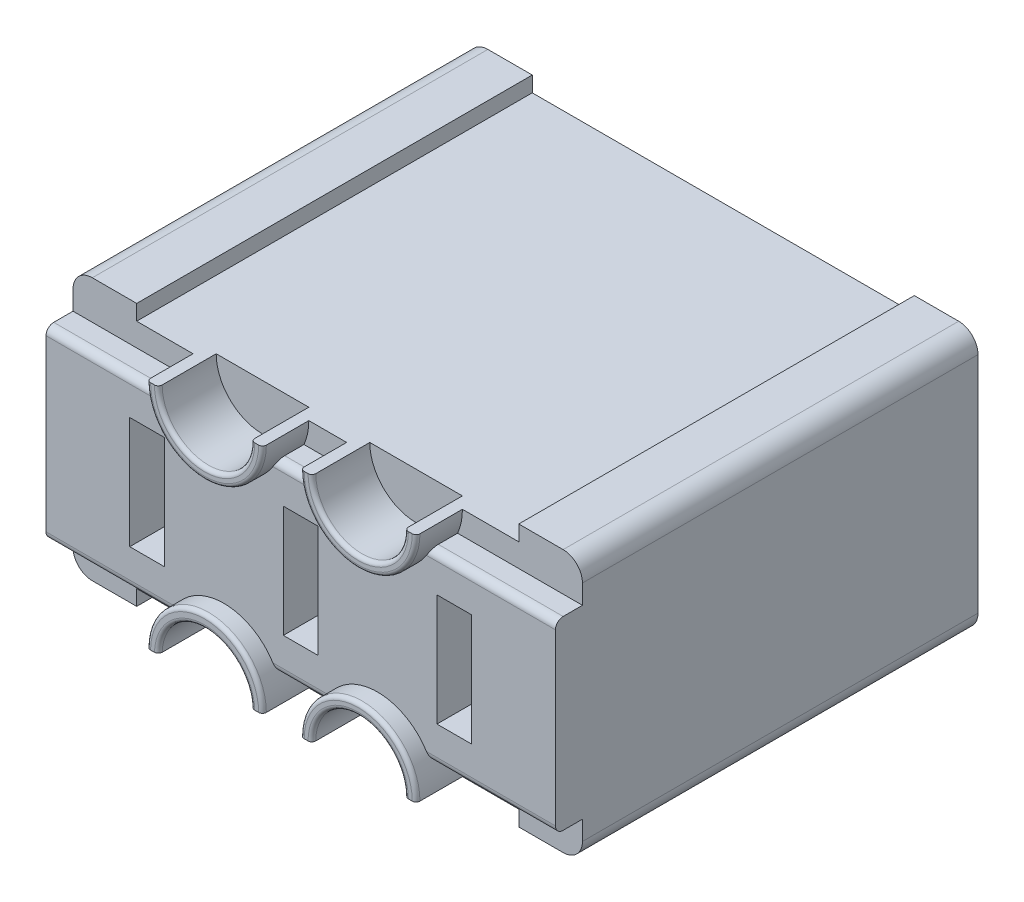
from build123d import *

# Parameters (mm, degrees)
ESQUISSE1_W             = 13.199999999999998
ESQUISSE1_H             = 6.799999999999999
BOSS_EXTRU_1_DEPTH      = 11.45
ESQUISSE2_W             = 9.9
ESQUISSE2_H             = 0.4
ENL_V_MAT_EXTRU_1_DEPTH = 19.75053332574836
ENL_V_MAT_EXTRU_4_DEPTH = 0.5
ENL_V_MAT_EXTRU_5_DEPTH = 1.5
ENL_V_MAT_EXTRU_7_DEPTH = 0.7
CONG_2_R                = 0.5
CONG_3_R                = 0.1
CONG_4_R                = 0.2
ESQUISSE7_W             = 0.8999999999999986
ESQUISSE7_H             = 2.9000000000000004
ENL_V_MAT_EXTRU_8_DEPTH = 19.44945811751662
ESQUISSE8_W             = 9.899999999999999
ESQUISSE8_H             = 4.399999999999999
ENL_V_MAT_EXTRU_9_DEPTH = 0.5


with BuildPart() as part:
    # Esquisse1 → Boss.-Extru.1 (new body)
    with BuildSketch(Plane.XY):
        with Locations((6.599999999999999, 3.3999999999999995)):
            Rectangle(ESQUISSE1_W, ESQUISSE1_H)
    extrude(amount=-BOSS_EXTRU_1_DEPTH)

    # Esquisse2 → Enl_v. mat.-Extru.1 (cut, through all)
    with BuildSketch(Plane.XY):
        Polygon((1.6500000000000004, 6.8), (11.55, 6.8), (11.55, 6.3999999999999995), (1.65, 6.3999999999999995), align=None)
        with Locations((6.6000000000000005, 0.2)):
            Rectangle(ESQUISSE2_W, ESQUISSE2_H)
    extrude(amount=-ENL_V_MAT_EXTRU_1_DEPTH, mode=Mode.SUBTRACT)

    # Esquisse4 → Enl_v. mat.-Extru.4 (cut)
    with BuildSketch(Plane.XY):
        with BuildLine():
            Line((3.1099999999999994, 6.3999999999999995), (1.65, 6.3999999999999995))
            Line((1.65, 6.3999999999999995), (1.6500000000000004, 6.8))
            Line((1.6500000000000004, 6.8), (0, 6.8))
            Line((0, 6.8), (0, 0))
            Line((0, 0), (1.65, 0))
            Line((1.65, 0), (1.65, 0.4))
            Line((1.65, 0.4), (3.1100000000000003, 0.4))
            ThreePointArc((3.1100000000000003, 0.4), (4.61, 1.9000000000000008), (6.110000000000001, 0.4))
            Line((6.110000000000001, 0.4), (7.090000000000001, 0.4))
            ThreePointArc((7.090000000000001, 0.4), (8.59, 1.9), (10.09, 0.4))
            Line((10.09, 0.4), (11.55, 0.4))
            Line((11.55, 0.4), (11.55, 0))
            Line((11.55, 0), (13.199999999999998, 0))
            Line((13.199999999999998, 0), (13.199999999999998, 6.800000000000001))
            Line((13.199999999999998, 6.800000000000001), (11.55, 6.8))
            Line((11.55, 6.8), (11.55, 6.3999999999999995))
            Line((11.55, 6.3999999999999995), (10.09, 6.3999999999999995))
            ThreePointArc((10.09, 6.3999999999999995), (8.59, 4.9), (7.090000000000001, 6.3999999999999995))
            Line((7.090000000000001, 6.3999999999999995), (6.109999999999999, 6.3999999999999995))
            ThreePointArc((6.109999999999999, 6.3999999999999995), (4.609999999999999, 4.8999999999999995), (3.1099999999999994, 6.3999999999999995))
        make_face()
    extrude(amount=-ENL_V_MAT_EXTRU_4_DEPTH, mode=Mode.SUBTRACT)

    # Esquisse5 → Enl_v. mat.-Extru.5 (cut)
    with BuildSketch(Plane.XY):
        with BuildLine():
            Line((3.4099999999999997, 6.3999999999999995), (5.81, 6.3999999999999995))
            ThreePointArc((5.81, 6.3999999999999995), (4.609999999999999, 5.199999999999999), (3.4099999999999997, 6.3999999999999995))
        make_face()
        with BuildLine():
            Line((7.390000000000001, 6.3999999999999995), (9.790000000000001, 6.3999999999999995))
            ThreePointArc((9.790000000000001, 6.3999999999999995), (8.59, 5.199999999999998), (7.390000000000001, 6.3999999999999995))
        make_face()
        with BuildLine():
            Line((3.4104721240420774, 0.4), (5.809527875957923, 0.4))
            ThreePointArc((5.809527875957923, 0.4), (4.61, 1.5663417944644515), (3.4104721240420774, 0.4))
        make_face()
        with BuildLine():
            Line((7.390000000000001, 0.3999999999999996), (9.790000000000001, 0.39999999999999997))
            ThreePointArc((9.790000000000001, 0.39999999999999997), (8.59, 1.600000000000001), (7.390000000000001, 0.3999999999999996))
        make_face()
    extrude(amount=-ENL_V_MAT_EXTRU_5_DEPTH, mode=Mode.SUBTRACT)

    # Esquisse6 → Enl_v. mat.-Extru.7 (cut)
    with BuildSketch(Plane.XY.offset(-0.5)):
        with BuildLine():
            ThreePointArc((3.2352272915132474, 5.8), (3.1416405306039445, 6.09353553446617), (3.1099999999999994, 6.3999999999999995))
            Line((3.1099999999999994, 6.3999999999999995), (1.65, 6.3999999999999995))
            Line((1.65, 6.3999999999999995), (1.6500000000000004, 6.8))
            Line((1.6500000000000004, 6.8), (0, 6.8))
            Line((0, 6.8), (0, 5.8))
            Line((0, 5.8), (3.2352272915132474, 5.8))
        make_face()
        with BuildLine():
            ThreePointArc((6.109999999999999, 6.3999999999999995), (6.078359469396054, 6.09353553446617), (5.9847727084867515, 5.8))
            Line((5.9847727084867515, 5.8), (7.215227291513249, 5.8))
            ThreePointArc((7.215227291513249, 5.8), (7.121640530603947, 6.093535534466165), (7.090000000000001, 6.399999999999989))
            Line((7.090000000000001, 6.399999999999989), (6.109999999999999, 6.3999999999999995))
        make_face()
        with BuildLine():
            ThreePointArc((10.09, 6.3999999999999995), (10.058359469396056, 6.09353553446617), (9.964772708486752, 5.8))
            Line((9.964772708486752, 5.8), (13.199999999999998, 5.8))
            Line((13.199999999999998, 5.8), (13.199999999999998, 6.800000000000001))
            Line((13.199999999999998, 6.800000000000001), (11.55, 6.8))
            Line((11.55, 6.8), (11.55, 6.3999999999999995))
            Line((11.55, 6.3999999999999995), (10.09, 6.3999999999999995))
        make_face()
        with BuildLine():
            Line((13.199999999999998, 0), (13.199999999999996, 1))
            Line((13.199999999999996, 1), (9.964772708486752, 1))
            ThreePointArc((9.964772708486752, 1), (10.058359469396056, 0.7064644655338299), (10.09, 0.39999999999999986))
            Line((10.09, 0.4), (11.55, 0.4))
            Line((11.55, 0.4), (11.55, 0))
            Line((11.55, 0), (13.199999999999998, 0))
        make_face()
        with BuildLine():
            Line((7.215227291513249, 1), (5.9847727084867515, 1))
            ThreePointArc((5.9847727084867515, 1), (6.078359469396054, 0.7064644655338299), (6.109999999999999, 0.3999999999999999))
            Line((6.109999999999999, 0.4), (7.090000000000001, 0.4000000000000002))
            ThreePointArc((7.090000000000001, 0.4000000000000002), (7.121640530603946, 0.70646446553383), (7.215227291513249, 1))
        make_face()
        with BuildLine():
            Line((3.2352272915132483, 1), (0, 1))
            Line((0, 1), (0, 0))
            Line((0, 0), (1.65, 0))
            Line((1.65, 0), (1.65, 0.4))
            Line((1.65, 0.4), (3.1100000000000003, 0.4))
            ThreePointArc((3.1100000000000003, 0.4), (3.1416405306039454, 0.7064644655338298), (3.2352272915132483, 0.9999999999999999))
        make_face()
    extrude(amount=-ENL_V_MAT_EXTRU_7_DEPTH, mode=Mode.SUBTRACT)

    # Cong_2
    cong_2_edges = [part.edges().sort_by_distance(p)[0] for p in [
        (0, 6.8, -6.325),
        (13.199999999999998, 6.8, -6.325),
        (13.199999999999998, 0, -6.325),
        (0, 0, -6.325),
    ]]
    fillet(cong_2_edges, radius=CONG_2_R)

    # Cong_3
    cong_3_edges = [part.edges().sort_by_distance(p)[0] for p in [
        (4.609999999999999, 5.199999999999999, 0),
        (8.590000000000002, 5.199999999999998, 0),
        (4.61, 1.5663417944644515, 0),
        (8.590000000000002, 1.6000000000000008, 0),
        (4.609999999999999, 4.8999999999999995, 0),
        (4.610000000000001, 1.9000000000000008, 0),
        (8.59, 1.9, 0),
        (8.59, 4.9, 0),
    ]]
    fillet(cong_3_edges, radius=CONG_3_R)

    # Cong_4
    cong_4_edges = [part.edges().sort_by_distance(p)[0] for p in [
        (1.6176136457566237, 5.8, -0.5),
        (6.6, 5.8, -0.5),
        (11.582386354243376, 5.8, -0.5),
        (11.582386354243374, 1, -0.5),
        (6.6, 1, -0.5),
        (1.6176136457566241, 1, -0.5),
    ]]
    fillet(cong_4_edges, radius=CONG_4_R)

    # Esquisse7 → Enl_v. mat.-Extru.8 (cut, through all)
    with BuildSketch(Plane.XY.offset(-0.5)):
        Polygon((2.169999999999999, 4.8500000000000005), (3.0699999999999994, 4.8500000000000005), (3.07, 1.9500000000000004), (2.1699999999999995, 1.9500000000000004), align=None)
        with Locations((6.6, 3.4000000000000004)):
            Rectangle(ESQUISSE7_W, ESQUISSE7_H)
        with Locations((10.58, 3.4000000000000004)):
            Rectangle(ESQUISSE7_W, ESQUISSE7_H)
    extrude(amount=-ENL_V_MAT_EXTRU_8_DEPTH, mode=Mode.SUBTRACT)

    # Esquisse8 → Enl_v. mat.-Extru.9 (cut)
    with BuildSketch(Plane(origin=(0, 0, -11.45), x_dir=(-1, 0, 0), z_dir=(0, 0, -1))):
        with Locations((-6.6, 3.3999999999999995)):
            Rectangle(ESQUISSE8_W, ESQUISSE8_H)
    extrude(amount=-ENL_V_MAT_EXTRU_9_DEPTH, mode=Mode.SUBTRACT)


solid = part.part
